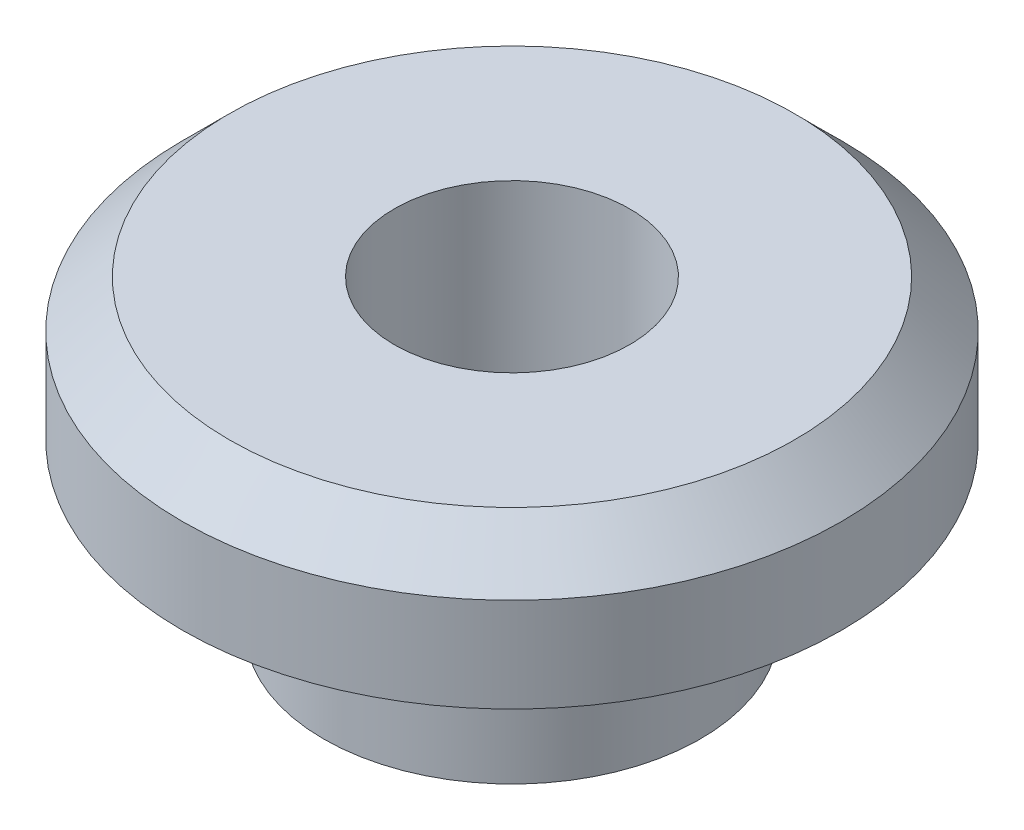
from build123d import *

# Parameters (mm, degrees)
SKETCH1_R      = 4
EXTRUDE1_DEPTH = 3.5
SKETCH2_R      = 7
EXTRUDE2_DEPTH = 3
SKETCH3_R      = 2.5
EXTRUDE3_DEPTH = 12.842719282
CHAMFER1_SIZE  = 1


with BuildPart() as part:
    # Sketch1 → Extrude1 (new body)
    with BuildSketch(Plane(origin=(0, 0, 0), x_dir=(1, 0, 0), z_dir=(0, 1, 0))):
        with Locations(Location((0, 0, 0), (0, 0, 270))):
            Circle(SKETCH1_R)
    extrude(amount=EXTRUDE1_DEPTH)

    # Sketch2 → Extrude2 (add)
    with BuildSketch(Plane(origin=(0, 3.5, 0), x_dir=(1, 0, 0), z_dir=(0, 1, 0))):
        with Locations(Location((0, 0, 0), (0, 0, 270))):
            Circle(SKETCH2_R)
    extrude(amount=EXTRUDE2_DEPTH)

    # Sketch3 → Extrude3 (cut, through all)
    with BuildSketch(Plane(origin=(0, 6.5, 0), x_dir=(1, 0, 0), z_dir=(0, 1, 0))):
        with Locations(Location((0, 0, 0), (0, 0, 270))):
            Circle(SKETCH3_R)
    extrude(amount=-EXTRUDE3_DEPTH, mode=Mode.SUBTRACT)

    # Chamfer1
    chamfer1_edges = [part.edges().sort_by_distance(p)[0] for p in [
        (0, 6.5, -7),
    ]]
    chamfer(chamfer1_edges, length=CHAMFER1_SIZE)


solid = part.part
